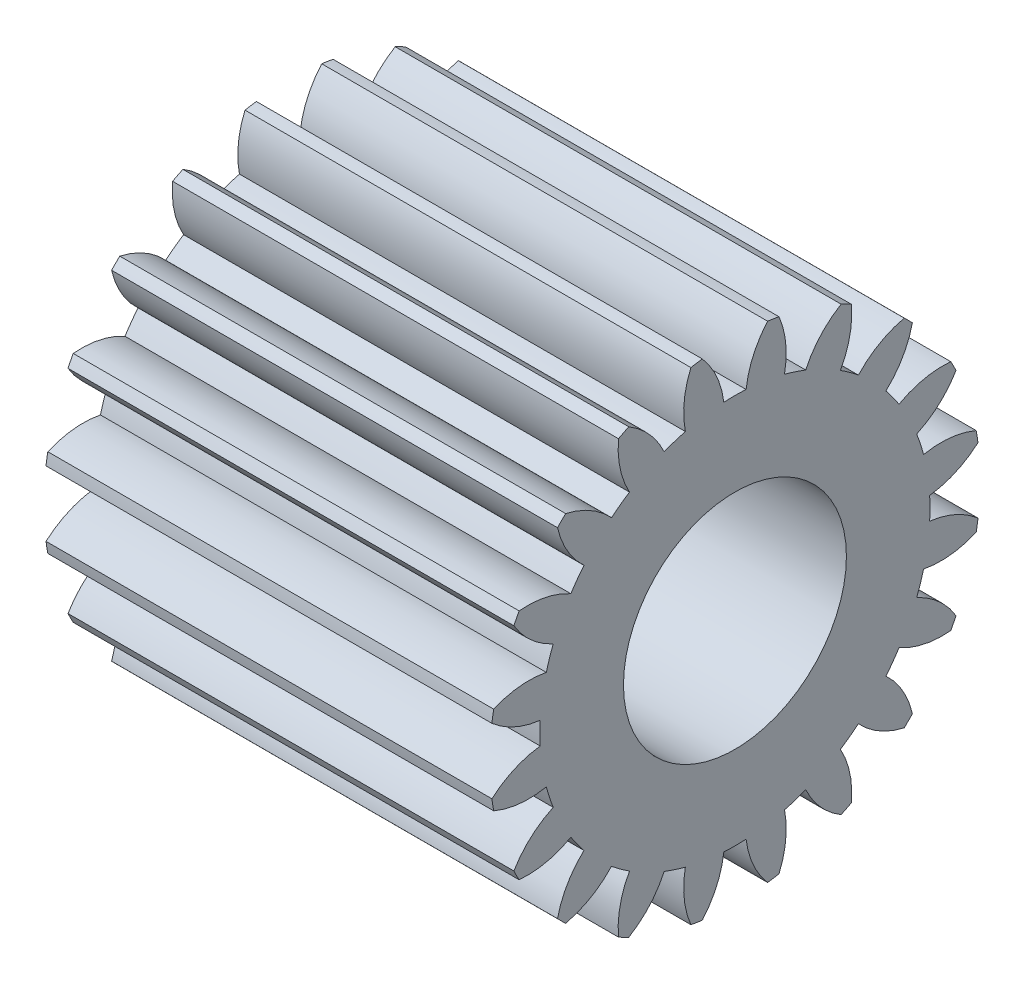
from build123d import *

# Parameters (mm, degrees)
BASPROSKE_W     = 10
BASPROSKE_H     = 5.5
TOOTHCUT_DEPTH  = 13.668859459
TEETHCUTS_COUNT = 20
TEETHCUTS_ANGLE = 342
BORSKE_R        = 2.5
BORE_DEPTH      = 50.0000508


with BuildPart() as part:
    # BasProSke → Base-Revolve (revolve)
    with BuildSketch(Plane(origin=(0, 0, 0), x_dir=(1, 0, 0), z_dir=(0, 1, 0)), mode=Mode.PRIVATE) as base_revolve_sk:
        with Locations((5, 2.75)):
            Rectangle(BASPROSKE_W, BASPROSKE_H)
    revolve(base_revolve_sk.sketch.rotate(Axis((-10, 0, 0), (1, 0, 0)), 180), axis=Axis((-10, 0, 0), (1, 0, 0)))

    # TooCutSke → ToothCut (cut, through all)
    with BuildSketch(Plane(origin=(0, 0, 0), x_dir=(0, 0, -1), z_dir=(1, 0, 0))):
        with BuildLine():
            ThreePointArc((0.249903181, 4.366855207), (0, 4.374), (-0.249903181, 4.366855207))
            ThreePointArc((-0.249903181, 4.366855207), (-0.415207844, 4.95951031), (-0.752843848, 5.473871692))
            ThreePointArc((-0.752843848, 5.473871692), (0, 5.5254), (0.752843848, 5.473871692))
            ThreePointArc((0.752843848, 5.473871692), (0.415207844, 4.95951031), (0.249903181, 4.366855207))
        make_face()
    toothcut = extrude(amount=TOOTHCUT_DEPTH, mode=Mode.SUBTRACT)

    # TeethCuts: ToothCut ×20 about axis
    teethcuts_axis = Axis((-10, 0, 0), (1, 0, 0))
    for i in range(1, TEETHCUTS_COUNT):
        add(toothcut.rotate(teethcuts_axis, i * TEETHCUTS_ANGLE / (TEETHCUTS_COUNT - 1)), mode=Mode.SUBTRACT)

    # BorSke → Bore (cut, symmetric)
    with BuildSketch(Plane(origin=(0, 0, 0), x_dir=(0, 0, -1), z_dir=(1, 0, 0))):
        with Locations(Location((0, 0, 0), (0, 0, 180))):
            Circle(BORSKE_R)
    extrude(amount=BORE_DEPTH, both=True, mode=Mode.SUBTRACT)


solid = part.part
